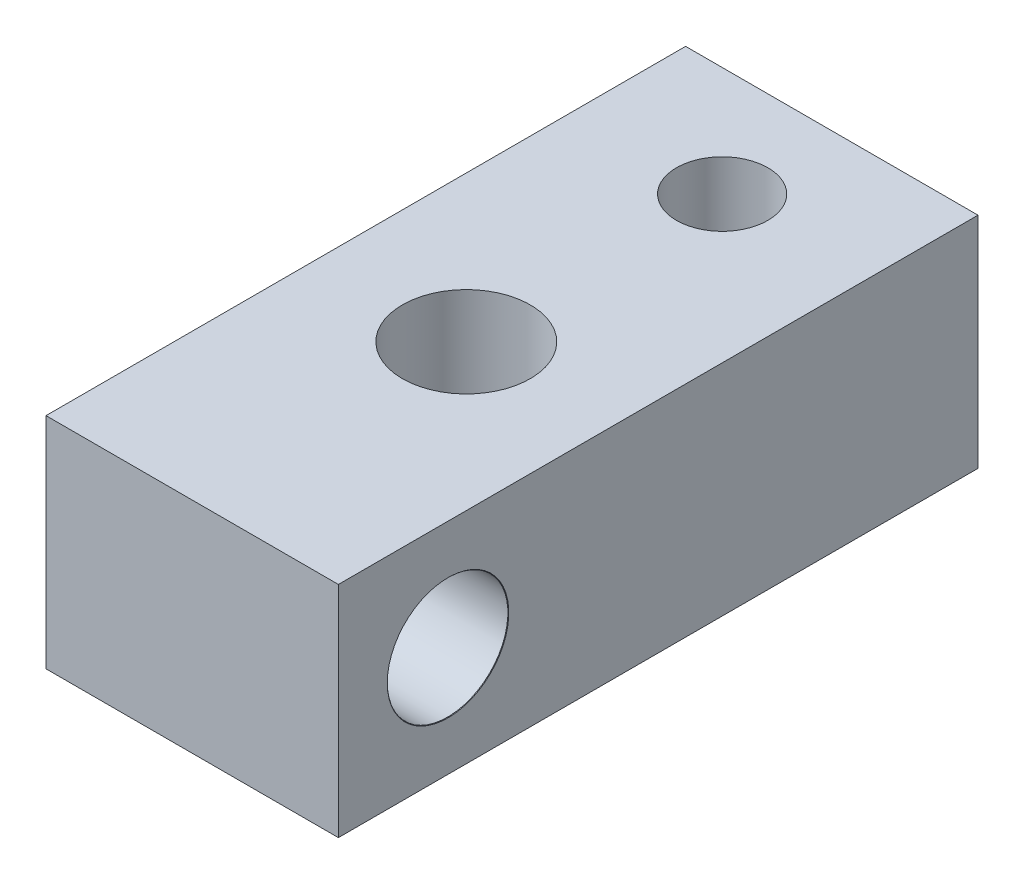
ISO-10303-21;
HEADER;
FILE_DESCRIPTION(('STEP AP214'),'2;1');
FILE_NAME('part.step','',(''),(''),'','','');
FILE_SCHEMA(('AUTOMOTIVE_DESIGN { 1 0 10303 214 1 1 1 1 }'));
ENDSEC;
DATA;
#1=APPLICATION_CONTEXT('core data for automotive mechanical design processes');
#2=APPLICATION_PROTOCOL_DEFINITION('international standard','automotive_design',2000,#1);
#3=PRODUCT_CONTEXT('',#1,'mechanical');
#4=PRODUCT('Part','Part','',(#3));
#5=PRODUCT_RELATED_PRODUCT_CATEGORY('part','',(#4));
#6=PRODUCT_DEFINITION_FORMATION('','',#4);
#7=PRODUCT_DEFINITION_CONTEXT('part definition',#1,'design');
#8=PRODUCT_DEFINITION('design','',#6,#7);
#9=PRODUCT_DEFINITION_SHAPE('','',#8);
#10=(LENGTH_UNIT() NAMED_UNIT(*) SI_UNIT(.MILLI.,.METRE.));
#11=(NAMED_UNIT(*) PLANE_ANGLE_UNIT() SI_UNIT($,.RADIAN.));
#12=(NAMED_UNIT(*) SI_UNIT($,.STERADIAN.) SOLID_ANGLE_UNIT());
#13=UNCERTAINTY_MEASURE_WITH_UNIT(LENGTH_MEASURE(1.E-05),#10,'distance_accuracy_value','');
#14=(GEOMETRIC_REPRESENTATION_CONTEXT(3) GLOBAL_UNCERTAINTY_ASSIGNED_CONTEXT((#13)) GLOBAL_UNIT_ASSIGNED_CONTEXT((#10,
#11,#12)) REPRESENTATION_CONTEXT('',''));
#15=CARTESIAN_POINT('',(0.,0.,0.));
#16=DIRECTION('',(0.,0.,1.));
#17=DIRECTION('',(1.,0.,0.));
#18=AXIS2_PLACEMENT_3D('',#15,#16,#17);
#19=CARTESIAN_POINT('',(-38.,88.,-35.));
#20=DIRECTION('',(1.,0.,0.));
#21=DIRECTION('',(0.,0.,-1.));
#22=AXIS2_PLACEMENT_3D('',#19,#20,#21);
#23=PLANE('',#22);
#24=CARTESIAN_POINT('',(-38.,82.,-6.));
#25=DIRECTION('',(-1.,0.,0.));
#26=DIRECTION('',(0.,0.,1.));
#27=AXIS2_PLACEMENT_3D('',#24,#25,#26);
#28=CIRCLE('',#27,3.325);
#29=CARTESIAN_POINT('',(-38.,82.,-2.675));
#30=VERTEX_POINT('',#29);
#31=EDGE_CURVE('E127',#30,#30,#28,.T.);
#32=ORIENTED_EDGE('',*,*,#31,.T.);
#33=EDGE_LOOP('',(#32));
#34=FACE_BOUND('',#33,.T.);
#35=DIRECTION('',(0.,1.,0.));
#36=VECTOR('',#35,1.);
#37=CARTESIAN_POINT('',(-38.,88.,0.));
#38=LINE('',#37,#36);
#39=CARTESIAN_POINT('',(-38.,76.,0.));
#40=VERTEX_POINT('',#39);
#41=CARTESIAN_POINT('',(-38.,88.,0.));
#42=VERTEX_POINT('',#41);
#43=EDGE_CURVE('E81',#40,#42,#38,.T.);
#44=ORIENTED_EDGE('',*,*,#43,.F.);
#45=DIRECTION('',(0.,0.,1.));
#46=VECTOR('',#45,1.);
#47=CARTESIAN_POINT('',(-38.,76.,-35.));
#48=LINE('',#47,#46);
#49=CARTESIAN_POINT('',(-38.,76.,-35.));
#50=VERTEX_POINT('',#49);
#51=EDGE_CURVE('E11',#50,#40,#48,.T.);
#52=ORIENTED_EDGE('',*,*,#51,.F.);
#53=DIRECTION('',(0.,1.,0.));
#54=VECTOR('',#53,1.);
#55=CARTESIAN_POINT('',(-38.,88.,-35.));
#56=LINE('',#55,#54);
#57=CARTESIAN_POINT('',(-38.,88.,-35.));
#58=VERTEX_POINT('',#57);
#59=EDGE_CURVE('E74',#50,#58,#56,.T.);
#60=ORIENTED_EDGE('',*,*,#59,.T.);
#61=DIRECTION('',(0.,0.,1.));
#62=VECTOR('',#61,1.);
#63=CARTESIAN_POINT('',(-38.,88.,-35.));
#64=LINE('',#63,#62);
#65=EDGE_CURVE('E19',#58,#42,#64,.T.);
#66=ORIENTED_EDGE('',*,*,#65,.T.);
#67=EDGE_LOOP('',(#44,#52,#60,#66));
#68=FACE_BOUND('',#67,.T.);
#69=ADVANCED_FACE('F16',(#34,#68),#23,.T.);
#70=CARTESIAN_POINT('',(-38.,76.,-35.));
#71=DIRECTION('',(0.,-1.,0.));
#72=DIRECTION('',(0.,0.,-1.));
#73=AXIS2_PLACEMENT_3D('',#70,#71,#72);
#74=PLANE('',#73);
#75=CARTESIAN_POINT('',(-46.,76.,-15.));
#76=DIRECTION('',(0.,1.,0.));
#77=DIRECTION('',(0.,0.,1.));
#78=AXIS2_PLACEMENT_3D('',#75,#76,#77);
#79=CIRCLE('',#78,3.5);
#80=CARTESIAN_POINT('',(-46.,76.,-11.5));
#81=VERTEX_POINT('',#80);
#82=EDGE_CURVE('E124',#81,#81,#79,.T.);
#83=ORIENTED_EDGE('',*,*,#82,.T.);
#84=EDGE_LOOP('',(#83));
#85=FACE_BOUND('',#84,.T.);
#86=CARTESIAN_POINT('',(-46.,76.,-29.));
#87=DIRECTION('',(0.,1.,0.));
#88=DIRECTION('',(0.,0.,1.));
#89=AXIS2_PLACEMENT_3D('',#86,#87,#88);
#90=CIRCLE('',#89,2.5);
#91=CARTESIAN_POINT('',(-46.,76.,-26.5));
#92=VERTEX_POINT('',#91);
#93=EDGE_CURVE('E123',#92,#92,#90,.T.);
#94=ORIENTED_EDGE('',*,*,#93,.T.);
#95=EDGE_LOOP('',(#94));
#96=FACE_BOUND('',#95,.T.);
#97=DIRECTION('',(1.,0.,0.));
#98=VECTOR('',#97,1.);
#99=CARTESIAN_POINT('',(-38.,76.,0.));
#100=LINE('',#99,#98);
#101=CARTESIAN_POINT('',(-54.,76.,0.));
#102=VERTEX_POINT('',#101);
#103=EDGE_CURVE('E76',#102,#40,#100,.T.);
#104=ORIENTED_EDGE('',*,*,#103,.F.);
#105=DIRECTION('',(0.,0.,1.));
#106=VECTOR('',#105,1.);
#107=CARTESIAN_POINT('',(-54.,76.,-35.));
#108=LINE('',#107,#106);
#109=CARTESIAN_POINT('',(-54.,76.,-35.));
#110=VERTEX_POINT('',#109);
#111=EDGE_CURVE('E25',#110,#102,#108,.T.);
#112=ORIENTED_EDGE('',*,*,#111,.F.);
#113=DIRECTION('',(1.,0.,0.));
#114=VECTOR('',#113,1.);
#115=CARTESIAN_POINT('',(-38.,76.,-35.));
#116=LINE('',#115,#114);
#117=EDGE_CURVE('E71',#110,#50,#116,.T.);
#118=ORIENTED_EDGE('',*,*,#117,.T.);
#119=ORIENTED_EDGE('',*,*,#51,.T.);
#120=EDGE_LOOP('',(#104,#112,#118,#119));
#121=FACE_BOUND('',#120,.T.);
#122=ADVANCED_FACE('F92',(#85,#96,#121),#74,.T.);
#123=CARTESIAN_POINT('',(-54.,88.,-35.));
#124=DIRECTION('',(-1.,0.,0.));
#125=DIRECTION('',(0.,0.,1.));
#126=AXIS2_PLACEMENT_3D('',#123,#124,#125);
#127=PLANE('',#126);
#128=CARTESIAN_POINT('',(-54.,82.,-6.));
#129=DIRECTION('',(-1.,0.,0.));
#130=DIRECTION('',(0.,0.,1.));
#131=AXIS2_PLACEMENT_3D('',#128,#129,#130);
#132=CIRCLE('',#131,5.525);
#133=CARTESIAN_POINT('',(-54.,82.,-0.475));
#134=VERTEX_POINT('',#133);
#135=EDGE_CURVE('E134',#134,#134,#132,.T.);
#136=ORIENTED_EDGE('',*,*,#135,.F.);
#137=EDGE_LOOP('',(#136));
#138=FACE_BOUND('',#137,.T.);
#139=DIRECTION('',(0.,-1.,0.));
#140=VECTOR('',#139,1.);
#141=CARTESIAN_POINT('',(-54.,88.,0.));
#142=LINE('',#141,#140);
#143=CARTESIAN_POINT('',(-54.,88.,0.));
#144=VERTEX_POINT('',#143);
#145=EDGE_CURVE('E66',#144,#102,#142,.T.);
#146=ORIENTED_EDGE('',*,*,#145,.F.);
#147=DIRECTION('',(0.,0.,1.));
#148=VECTOR('',#147,1.);
#149=CARTESIAN_POINT('',(-54.,88.,-35.));
#150=LINE('',#149,#148);
#151=CARTESIAN_POINT('',(-54.,88.,-35.));
#152=VERTEX_POINT('',#151);
#153=EDGE_CURVE('E61',#152,#144,#150,.T.);
#154=ORIENTED_EDGE('',*,*,#153,.F.);
#155=DIRECTION('',(0.,-1.,0.));
#156=VECTOR('',#155,1.);
#157=CARTESIAN_POINT('',(-54.,88.,-35.));
#158=LINE('',#157,#156);
#159=EDGE_CURVE('E64',#152,#110,#158,.T.);
#160=ORIENTED_EDGE('',*,*,#159,.T.);
#161=ORIENTED_EDGE('',*,*,#111,.T.);
#162=EDGE_LOOP('',(#146,#154,#160,#161));
#163=FACE_BOUND('',#162,.T.);
#164=ADVANCED_FACE('F63',(#138,#163),#127,.T.);
#165=CARTESIAN_POINT('',(-38.,88.,-35.));
#166=DIRECTION('',(0.,1.,0.));
#167=DIRECTION('',(-1.,0.,0.));
#168=AXIS2_PLACEMENT_3D('',#165,#166,#167);
#169=PLANE('',#168);
#170=CARTESIAN_POINT('',(-46.,88.,-15.));
#171=DIRECTION('',(0.,1.,0.));
#172=DIRECTION('',(0.,0.,1.));
#173=AXIS2_PLACEMENT_3D('',#170,#171,#172);
#174=CIRCLE('',#173,3.5);
#175=CARTESIAN_POINT('',(-46.,88.,-11.5));
#176=VERTEX_POINT('',#175);
#177=EDGE_CURVE('E118',#176,#176,#174,.T.);
#178=ORIENTED_EDGE('',*,*,#177,.F.);
#179=EDGE_LOOP('',(#178));
#180=FACE_BOUND('',#179,.T.);
#181=CARTESIAN_POINT('',(-46.,88.,-29.));
#182=DIRECTION('',(0.,1.,0.));
#183=DIRECTION('',(0.,0.,1.));
#184=AXIS2_PLACEMENT_3D('',#181,#182,#183);
#185=CIRCLE('',#184,2.5);
#186=CARTESIAN_POINT('',(-46.,88.,-26.5));
#187=VERTEX_POINT('',#186);
#188=EDGE_CURVE('E121',#187,#187,#185,.T.);
#189=ORIENTED_EDGE('',*,*,#188,.F.);
#190=EDGE_LOOP('',(#189));
#191=FACE_BOUND('',#190,.T.);
#192=DIRECTION('',(-1.,0.,0.));
#193=VECTOR('',#192,1.);
#194=CARTESIAN_POINT('',(-38.,88.,0.));
#195=LINE('',#194,#193);
#196=EDGE_CURVE('E84',#42,#144,#195,.T.);
#197=ORIENTED_EDGE('',*,*,#196,.F.);
#198=ORIENTED_EDGE('',*,*,#65,.F.);
#199=DIRECTION('',(-1.,0.,0.));
#200=VECTOR('',#199,1.);
#201=CARTESIAN_POINT('',(-38.,88.,-35.));
#202=LINE('',#201,#200);
#203=EDGE_CURVE('E70',#58,#152,#202,.T.);
#204=ORIENTED_EDGE('',*,*,#203,.T.);
#205=ORIENTED_EDGE('',*,*,#153,.T.);
#206=EDGE_LOOP('',(#197,#198,#204,#205));
#207=FACE_BOUND('',#206,.T.);
#208=ADVANCED_FACE('F73',(#180,#191,#207),#169,.T.);
#209=CARTESIAN_POINT('',(0.,0.,-35.));
#210=DIRECTION('',(0.,0.,-1.));
#211=DIRECTION('',(-1.,0.,0.));
#212=AXIS2_PLACEMENT_3D('',#209,#210,#211);
#213=PLANE('',#212);
#214=ORIENTED_EDGE('',*,*,#59,.F.);
#215=ORIENTED_EDGE('',*,*,#117,.F.);
#216=ORIENTED_EDGE('',*,*,#159,.F.);
#217=ORIENTED_EDGE('',*,*,#203,.F.);
#218=EDGE_LOOP('',(#214,#215,#216,#217));
#219=FACE_BOUND('',#218,.T.);
#220=ADVANCED_FACE('F69',(#219),#213,.T.);
#221=CARTESIAN_POINT('',(0.,0.,0.));
#222=DIRECTION('',(0.,0.,-1.));
#223=DIRECTION('',(-1.,0.,0.));
#224=AXIS2_PLACEMENT_3D('',#221,#222,#223);
#225=PLANE('',#224);
#226=ORIENTED_EDGE('',*,*,#43,.T.);
#227=ORIENTED_EDGE('',*,*,#196,.T.);
#228=ORIENTED_EDGE('',*,*,#145,.T.);
#229=ORIENTED_EDGE('',*,*,#103,.T.);
#230=EDGE_LOOP('',(#226,#227,#228,#229));
#231=FACE_BOUND('',#230,.T.);
#232=ADVANCED_FACE('F91',(#231),#225,.F.);
#233=CARTESIAN_POINT('',(-38.025,82.,-6.));
#234=DIRECTION('',(1.,0.,0.));
#235=DIRECTION('',(0.,0.,-1.));
#236=AXIS2_PLACEMENT_3D('',#233,#234,#235);
#237=CONICAL_SURFACE('',#236,3.3,0.785398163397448);
#238=ORIENTED_EDGE('',*,*,#31,.F.);
#239=EDGE_LOOP('',(#238));
#240=FACE_BOUND('',#239,.T.);
#241=CARTESIAN_POINT('',(-38.025,82.,-6.));
#242=DIRECTION('',(-1.,0.,0.));
#243=DIRECTION('',(0.,0.,1.));
#244=AXIS2_PLACEMENT_3D('',#241,#242,#243);
#245=CIRCLE('',#244,3.3);
#246=CARTESIAN_POINT('',(-38.025,82.,-2.7));
#247=VERTEX_POINT('',#246);
#248=EDGE_CURVE('E85',#247,#247,#245,.T.);
#249=ORIENTED_EDGE('',*,*,#248,.T.);
#250=EDGE_LOOP('',(#249));
#251=FACE_BOUND('',#250,.T.);
#252=ADVANCED_FACE('F151',(#240,#251),#237,.F.);
#253=CARTESIAN_POINT('',(-54.,82.,-6.));
#254=DIRECTION('',(-1.,0.,0.));
#255=DIRECTION('',(0.,0.,1.));
#256=AXIS2_PLACEMENT_3D('',#253,#254,#255);
#257=CYLINDRICAL_SURFACE('',#256,3.3);
#258=ORIENTED_EDGE('',*,*,#248,.F.);
#259=EDGE_LOOP('',(#258));
#260=FACE_BOUND('',#259,.T.);
#261=CARTESIAN_POINT('',(-47.175,82.,-6.));
#262=DIRECTION('',(-1.,0.,0.));
#263=DIRECTION('',(0.,0.,1.));
#264=AXIS2_PLACEMENT_3D('',#261,#262,#263);
#265=CIRCLE('',#264,3.3);
#266=CARTESIAN_POINT('',(-47.175,82.,-2.7));
#267=VERTEX_POINT('',#266);
#268=EDGE_CURVE('E146',#267,#267,#265,.T.);
#269=ORIENTED_EDGE('',*,*,#268,.T.);
#270=EDGE_LOOP('',(#269));
#271=FACE_BOUND('',#270,.T.);
#272=ADVANCED_FACE('F153',(#260,#271),#257,.F.);
#273=CARTESIAN_POINT('',(-47.2,82.,-6.));
#274=DIRECTION('',(-1.,0.,0.));
#275=DIRECTION('',(0.,0.,1.));
#276=AXIS2_PLACEMENT_3D('',#273,#274,#275);
#277=CONICAL_SURFACE('',#276,3.325,0.785398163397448);
#278=ORIENTED_EDGE('',*,*,#268,.F.);
#279=EDGE_LOOP('',(#278));
#280=FACE_BOUND('',#279,.T.);
#281=CARTESIAN_POINT('',(-47.2,82.,-6.));
#282=DIRECTION('',(-1.,0.,0.));
#283=DIRECTION('',(0.,0.,1.));
#284=AXIS2_PLACEMENT_3D('',#281,#282,#283);
#285=CIRCLE('',#284,3.325);
#286=CARTESIAN_POINT('',(-47.2,82.,-2.675));
#287=VERTEX_POINT('',#286);
#288=EDGE_CURVE('E143',#287,#287,#285,.T.);
#289=ORIENTED_EDGE('',*,*,#288,.T.);
#290=EDGE_LOOP('',(#289));
#291=FACE_BOUND('',#290,.T.);
#292=ADVANCED_FACE('F156',(#280,#291),#277,.F.);
#293=CARTESIAN_POINT('',(-47.2,85.325,-6.));
#294=DIRECTION('',(1.,0.,0.));
#295=DIRECTION('',(0.,0.,-1.));
#296=AXIS2_PLACEMENT_3D('',#293,#294,#295);
#297=PLANE('',#296);
#298=ORIENTED_EDGE('',*,*,#288,.F.);
#299=EDGE_LOOP('',(#298));
#300=FACE_BOUND('',#299,.T.);
#301=CARTESIAN_POINT('',(-47.2,82.,-6.));
#302=DIRECTION('',(-1.,0.,0.));
#303=DIRECTION('',(0.,0.,1.));
#304=AXIS2_PLACEMENT_3D('',#301,#302,#303);
#305=CIRCLE('',#304,5.5);
#306=CARTESIAN_POINT('',(-47.2,82.,-0.5));
#307=VERTEX_POINT('',#306);
#308=EDGE_CURVE('E140',#307,#307,#305,.T.);
#309=ORIENTED_EDGE('',*,*,#308,.T.);
#310=EDGE_LOOP('',(#309));
#311=FACE_BOUND('',#310,.T.);
#312=ADVANCED_FACE('F162',(#300,#311),#297,.F.);
#313=CARTESIAN_POINT('',(-54.,82.,-6.));
#314=DIRECTION('',(-1.,0.,0.));
#315=DIRECTION('',(0.,0.,1.));
#316=AXIS2_PLACEMENT_3D('',#313,#314,#315);
#317=CYLINDRICAL_SURFACE('',#316,5.5);
#318=ORIENTED_EDGE('',*,*,#308,.F.);
#319=EDGE_LOOP('',(#318));
#320=FACE_BOUND('',#319,.T.);
#321=CARTESIAN_POINT('',(-53.975,82.,-6.));
#322=DIRECTION('',(-1.,0.,0.));
#323=DIRECTION('',(0.,0.,1.));
#324=AXIS2_PLACEMENT_3D('',#321,#322,#323);
#325=CIRCLE('',#324,5.5);
#326=CARTESIAN_POINT('',(-53.975,82.,-0.5));
#327=VERTEX_POINT('',#326);
#328=EDGE_CURVE('E137',#327,#327,#325,.T.);
#329=ORIENTED_EDGE('',*,*,#328,.T.);
#330=EDGE_LOOP('',(#329));
#331=FACE_BOUND('',#330,.T.);
#332=ADVANCED_FACE('F168',(#320,#331),#317,.F.);
#333=CARTESIAN_POINT('',(-54.,82.,-6.));
#334=DIRECTION('',(-1.,0.,0.));
#335=DIRECTION('',(0.,0.,1.));
#336=AXIS2_PLACEMENT_3D('',#333,#334,#335);
#337=CONICAL_SURFACE('',#336,5.525,0.785398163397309);
#338=ORIENTED_EDGE('',*,*,#328,.F.);
#339=EDGE_LOOP('',(#338));
#340=FACE_BOUND('',#339,.T.);
#341=ORIENTED_EDGE('',*,*,#135,.T.);
#342=EDGE_LOOP('',(#341));
#343=FACE_BOUND('',#342,.T.);
#344=ADVANCED_FACE('F174',(#340,#343),#337,.F.);
#345=CARTESIAN_POINT('',(-46.,88.,-29.));
#346=DIRECTION('',(0.,1.,0.));
#347=DIRECTION('',(0.,0.,1.));
#348=AXIS2_PLACEMENT_3D('',#345,#346,#347);
#349=CYLINDRICAL_SURFACE('',#348,2.5);
#350=ORIENTED_EDGE('',*,*,#93,.F.);
#351=EDGE_LOOP('',(#350));
#352=FACE_BOUND('',#351,.T.);
#353=ORIENTED_EDGE('',*,*,#188,.T.);
#354=EDGE_LOOP('',(#353));
#355=FACE_BOUND('',#354,.T.);
#356=ADVANCED_FACE('F180',(#352,#355),#349,.F.);
#357=CARTESIAN_POINT('',(-46.,88.,-15.));
#358=DIRECTION('',(0.,1.,0.));
#359=DIRECTION('',(0.,0.,1.));
#360=AXIS2_PLACEMENT_3D('',#357,#358,#359);
#361=CYLINDRICAL_SURFACE('',#360,3.5);
#362=ORIENTED_EDGE('',*,*,#82,.F.);
#363=EDGE_LOOP('',(#362));
#364=FACE_BOUND('',#363,.T.);
#365=ORIENTED_EDGE('',*,*,#177,.T.);
#366=EDGE_LOOP('',(#365));
#367=FACE_BOUND('',#366,.T.);
#368=ADVANCED_FACE('F188',(#364,#367),#361,.F.);
#369=CLOSED_SHELL('',(#69,#122,#164,#208,#220,#232,#252,#272,#292,#312,#332,#344,#356,#368));
#370=MANIFOLD_SOLID_BREP('B1',#369);
#371=ADVANCED_BREP_SHAPE_REPRESENTATION('',(#18,#370),#14);
#372=SHAPE_DEFINITION_REPRESENTATION(#9,#371);
ENDSEC;
END-ISO-10303-21;
